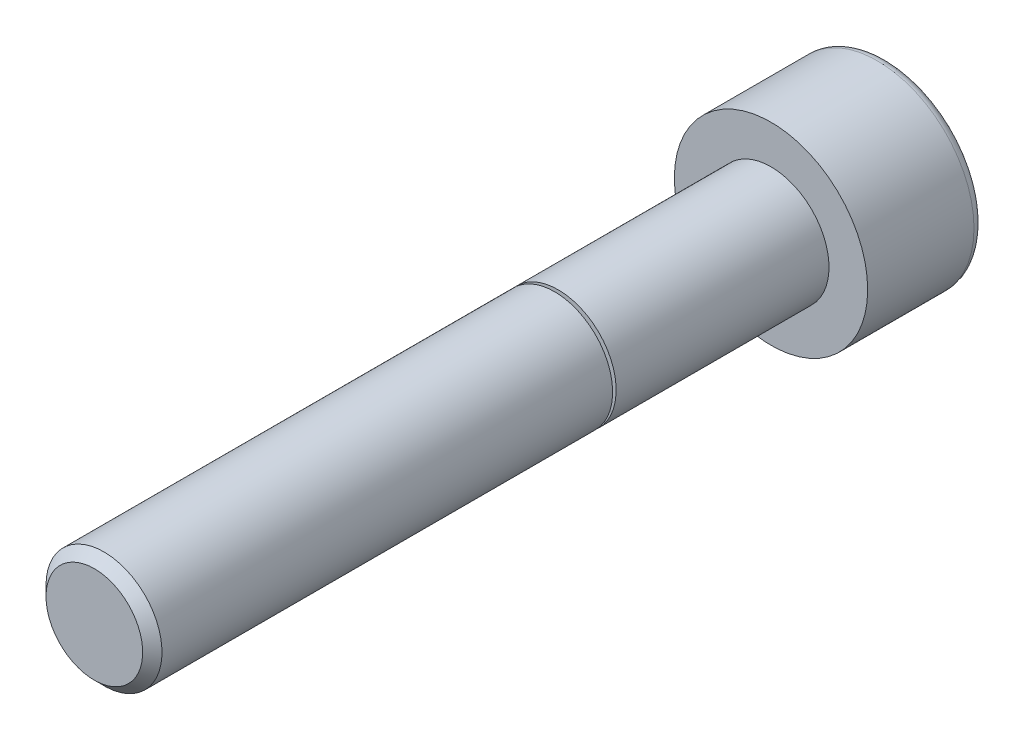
from build123d import *

# Parameters (mm, degrees)
CUT_EXTRUDE1_DEPTH = 2.5


with BuildPart() as part:
    # Logo3_bib1 → Revolve1 (revolve)
    with BuildSketch(Plane(origin=(0, 0, 0), x_dir=(-1, 0, 0), z_dir=(0, -1, 0))):
        with BuildLine():
            Line((0, -35), (0, 6))
            Line((0, 6), (4.5, 6))
            ThreePointArc((4.5, 6), (4.853553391, 5.853553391), (5, 5.5))
            Line((5, 5.5), (5, 0))
            Line((5, 0), (3, 0))
            Line((3, 0), (3, -11.01))
            Line((3, -11.01), (2.613425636, -11.01))
            ThreePointArc((2.613425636, -11.01), (2.593729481, -11.026527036), (2.606585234, -11.048793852))
            Line((2.606585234, -11.048793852), (3, -11.191985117))
            Line((3, -11.191985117), (3, -34.5))
            Line((3, -34.5), (2.5, -35))
            Line((2.5, -35), (0, -35))
        make_face()
    revolve(axis=Axis((0, 0, -10.585154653), (0, 0, 1)))

    # Logo3_bib2 → Cut-Extrude1 (cut)
    with BuildSketch(Plane(origin=(0, 0, -6), x_dir=(1, 0, 0), z_dir=(0, 0, -1))):
        Polygon((2.886751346, 0), (1.443375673, 2.5), (-1.443375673, 2.5), (-2.886751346, 0), (-1.443375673, -2.5), (1.443375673, -2.5), align=None)
    extrude(amount=-CUT_EXTRUDE1_DEPTH, mode=Mode.SUBTRACT)


solid = part.part
